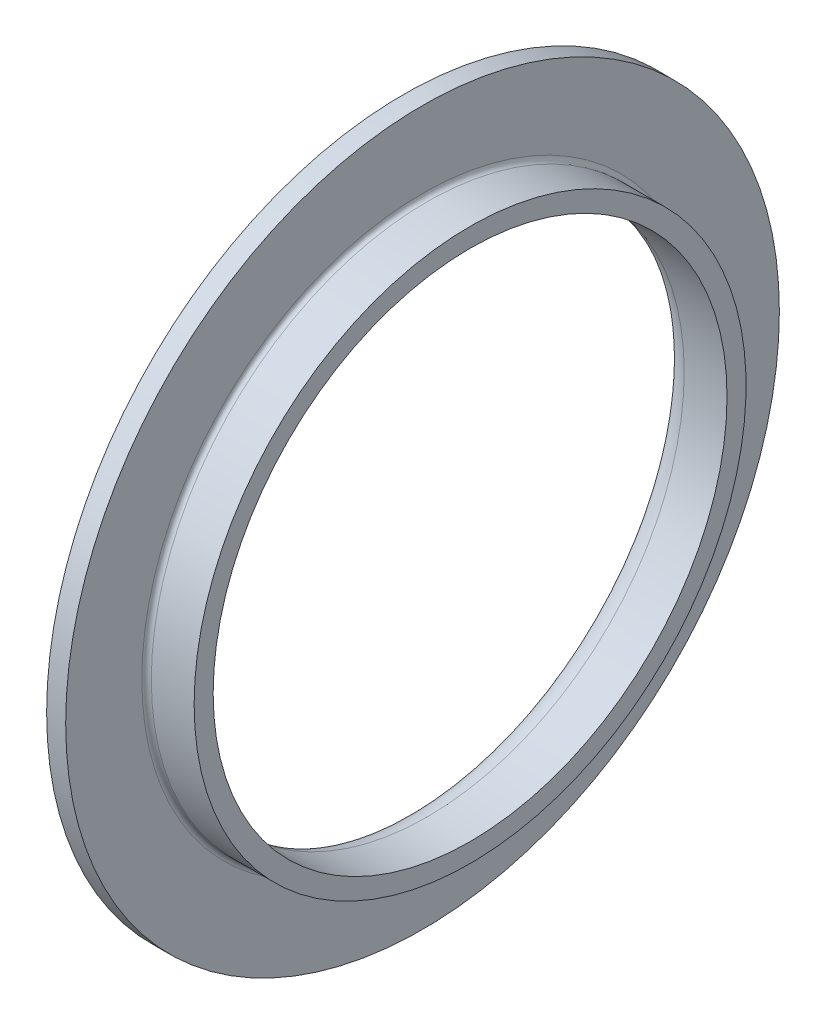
ISO-10303-21;
HEADER;
FILE_DESCRIPTION(('STEP AP214'),'2;1');
FILE_NAME('part.step','',(''),(''),'','','');
FILE_SCHEMA(('AUTOMOTIVE_DESIGN { 1 0 10303 214 1 1 1 1 }'));
ENDSEC;
DATA;
#1=APPLICATION_CONTEXT('core data for automotive mechanical design processes');
#2=APPLICATION_PROTOCOL_DEFINITION('international standard','automotive_design',2000,#1);
#3=PRODUCT_CONTEXT('',#1,'mechanical');
#4=PRODUCT('Part','Part','',(#3));
#5=PRODUCT_RELATED_PRODUCT_CATEGORY('part','',(#4));
#6=PRODUCT_DEFINITION_FORMATION('','',#4);
#7=PRODUCT_DEFINITION_CONTEXT('part definition',#1,'design');
#8=PRODUCT_DEFINITION('design','',#6,#7);
#9=PRODUCT_DEFINITION_SHAPE('','',#8);
#10=(LENGTH_UNIT() NAMED_UNIT(*) SI_UNIT(.MILLI.,.METRE.));
#11=(NAMED_UNIT(*) PLANE_ANGLE_UNIT() SI_UNIT($,.RADIAN.));
#12=(NAMED_UNIT(*) SI_UNIT($,.STERADIAN.) SOLID_ANGLE_UNIT());
#13=UNCERTAINTY_MEASURE_WITH_UNIT(LENGTH_MEASURE(1.E-05),#10,'distance_accuracy_value','');
#14=(GEOMETRIC_REPRESENTATION_CONTEXT(3) GLOBAL_UNCERTAINTY_ASSIGNED_CONTEXT((#13)) GLOBAL_UNIT_ASSIGNED_CONTEXT((#10,
#11,#12)) REPRESENTATION_CONTEXT('',''));
#15=CARTESIAN_POINT('',(0.,0.,0.));
#16=DIRECTION('',(0.,0.,1.));
#17=DIRECTION('',(1.,0.,0.));
#18=AXIS2_PLACEMENT_3D('',#15,#16,#17);
#19=CARTESIAN_POINT('',(0.,0.,0.));
#20=DIRECTION('',(-1.,0.,0.));
#21=DIRECTION('',(0.,0.,1.));
#22=AXIS2_PLACEMENT_3D('',#19,#20,#21);
#23=CYLINDRICAL_SURFACE('',#22,27.);
#24=CARTESIAN_POINT('',(7.,0.,0.));
#25=DIRECTION('',(-1.,0.,0.));
#26=DIRECTION('',(0.,0.,1.));
#27=AXIS2_PLACEMENT_3D('',#24,#25,#26);
#28=CIRCLE('',#27,27.);
#29=CARTESIAN_POINT('',(7.,0.,27.));
#30=VERTEX_POINT('',#29);
#31=EDGE_CURVE('E10',#30,#30,#28,.T.);
#32=ORIENTED_EDGE('',*,*,#31,.F.);
#33=EDGE_LOOP('',(#32));
#34=FACE_BOUND('',#33,.T.);
#35=CARTESIAN_POINT('',(2.50000000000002,0.,0.));
#36=DIRECTION('',(-1.,0.,0.));
#37=DIRECTION('',(0.,0.,1.));
#38=AXIS2_PLACEMENT_3D('',#35,#36,#37);
#39=CIRCLE('',#38,27.);
#40=CARTESIAN_POINT('',(2.50000000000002,0.,27.));
#41=VERTEX_POINT('',#40);
#42=EDGE_CURVE('E58',#41,#41,#39,.T.);
#43=ORIENTED_EDGE('',*,*,#42,.T.);
#44=EDGE_LOOP('',(#43));
#45=FACE_BOUND('',#44,.T.);
#46=ADVANCED_FACE('F30',(#34,#45),#23,.F.);
#47=CARTESIAN_POINT('',(7.,29.,0.));
#48=DIRECTION('',(1.,0.,0.));
#49=DIRECTION('',(0.,0.,-1.));
#50=AXIS2_PLACEMENT_3D('',#47,#48,#49);
#51=PLANE('',#50);
#52=ORIENTED_EDGE('',*,*,#31,.T.);
#53=EDGE_LOOP('',(#52));
#54=FACE_BOUND('',#53,.T.);
#55=CARTESIAN_POINT('',(7.,0.,0.));
#56=DIRECTION('',(-1.,0.,0.));
#57=DIRECTION('',(0.,0.,1.));
#58=AXIS2_PLACEMENT_3D('',#55,#56,#57);
#59=CIRCLE('',#58,29.);
#60=CARTESIAN_POINT('',(7.,0.,29.));
#61=VERTEX_POINT('',#60);
#62=EDGE_CURVE('E36',#61,#61,#59,.T.);
#63=ORIENTED_EDGE('',*,*,#62,.F.);
#64=EDGE_LOOP('',(#63));
#65=FACE_BOUND('',#64,.T.);
#66=ADVANCED_FACE('F87',(#54,#65),#51,.T.);
#67=CARTESIAN_POINT('',(0.,0.,0.));
#68=DIRECTION('',(-1.,0.,0.));
#69=DIRECTION('',(0.,0.,1.));
#70=AXIS2_PLACEMENT_3D('',#67,#68,#69);
#71=CYLINDRICAL_SURFACE('',#70,29.);
#72=ORIENTED_EDGE('',*,*,#62,.T.);
#73=EDGE_LOOP('',(#72));
#74=FACE_BOUND('',#73,.T.);
#75=CARTESIAN_POINT('',(2.50000000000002,0.,0.));
#76=DIRECTION('',(-1.,0.,0.));
#77=DIRECTION('',(0.,0.,1.));
#78=AXIS2_PLACEMENT_3D('',#75,#76,#77);
#79=CIRCLE('',#78,29.);
#80=CARTESIAN_POINT('',(2.50000000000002,0.,29.));
#81=VERTEX_POINT('',#80);
#82=EDGE_CURVE('E40',#81,#81,#79,.T.);
#83=ORIENTED_EDGE('',*,*,#82,.F.);
#84=EDGE_LOOP('',(#83));
#85=FACE_BOUND('',#84,.T.);
#86=ADVANCED_FACE('F92',(#74,#85),#71,.T.);
#87=CARTESIAN_POINT('',(2.5,0.,0.));
#88=DIRECTION('',(-1.,0.,0.));
#89=DIRECTION('',(0.,0.,1.));
#90=AXIS2_PLACEMENT_3D('',#87,#88,#89);
#91=TOROIDAL_SURFACE('',#90,29.5,0.499999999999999);
#92=ORIENTED_EDGE('',*,*,#82,.T.);
#93=EDGE_LOOP('',(#92));
#94=FACE_BOUND('',#93,.T.);
#95=CARTESIAN_POINT('',(2.,0.,0.));
#96=DIRECTION('',(-1.,0.,0.));
#97=DIRECTION('',(0.,0.,1.));
#98=AXIS2_PLACEMENT_3D('',#95,#96,#97);
#99=CIRCLE('',#98,29.5);
#100=CARTESIAN_POINT('',(2.,0.,29.5));
#101=VERTEX_POINT('',#100);
#102=EDGE_CURVE('E44',#101,#101,#99,.T.);
#103=ORIENTED_EDGE('',*,*,#102,.F.);
#104=EDGE_LOOP('',(#103));
#105=FACE_BOUND('',#104,.T.);
#106=ADVANCED_FACE('F83',(#94,#105),#91,.F.);
#107=CARTESIAN_POINT('',(2.,37.5,0.));
#108=DIRECTION('',(1.,0.,0.));
#109=DIRECTION('',(0.,0.,-1.));
#110=AXIS2_PLACEMENT_3D('',#107,#108,#109);
#111=PLANE('',#110);
#112=ORIENTED_EDGE('',*,*,#102,.T.);
#113=EDGE_LOOP('',(#112));
#114=FACE_BOUND('',#113,.T.);
#115=CARTESIAN_POINT('',(2.,0.,0.));
#116=DIRECTION('',(-1.,0.,0.));
#117=DIRECTION('',(0.,0.,1.));
#118=AXIS2_PLACEMENT_3D('',#115,#116,#117);
#119=CIRCLE('',#118,37.5);
#120=CARTESIAN_POINT('',(2.,0.,37.5));
#121=VERTEX_POINT('',#120);
#122=EDGE_CURVE('E49',#121,#121,#119,.T.);
#123=ORIENTED_EDGE('',*,*,#122,.F.);
#124=EDGE_LOOP('',(#123));
#125=FACE_BOUND('',#124,.T.);
#126=ADVANCED_FACE('F77',(#114,#125),#111,.T.);
#127=CARTESIAN_POINT('',(0.,0.,0.));
#128=DIRECTION('',(-1.,0.,0.));
#129=DIRECTION('',(0.,0.,1.));
#130=AXIS2_PLACEMENT_3D('',#127,#128,#129);
#131=CYLINDRICAL_SURFACE('',#130,37.5);
#132=ORIENTED_EDGE('',*,*,#122,.T.);
#133=EDGE_LOOP('',(#132));
#134=FACE_BOUND('',#133,.T.);
#135=CARTESIAN_POINT('',(0.,0.,0.));
#136=DIRECTION('',(-1.,0.,0.));
#137=DIRECTION('',(0.,0.,1.));
#138=AXIS2_PLACEMENT_3D('',#135,#136,#137);
#139=CIRCLE('',#138,37.5);
#140=CARTESIAN_POINT('',(0.,0.,37.5));
#141=VERTEX_POINT('',#140);
#142=EDGE_CURVE('E52',#141,#141,#139,.T.);
#143=ORIENTED_EDGE('',*,*,#142,.F.);
#144=EDGE_LOOP('',(#143));
#145=FACE_BOUND('',#144,.T.);
#146=ADVANCED_FACE('F72',(#134,#145),#131,.T.);
#147=CARTESIAN_POINT('',(0.,37.5,0.));
#148=DIRECTION('',(1.,0.,0.));
#149=DIRECTION('',(0.,0.,-1.));
#150=AXIS2_PLACEMENT_3D('',#147,#148,#149);
#151=PLANE('',#150);
#152=CARTESIAN_POINT('',(0.,0.,0.));
#153=DIRECTION('',(-1.,0.,0.));
#154=DIRECTION('',(0.,0.,1.));
#155=AXIS2_PLACEMENT_3D('',#152,#153,#154);
#156=CIRCLE('',#155,29.5);
#157=CARTESIAN_POINT('',(0.,0.,29.5));
#158=VERTEX_POINT('',#157);
#159=EDGE_CURVE('E55',#158,#158,#156,.T.);
#160=ORIENTED_EDGE('',*,*,#159,.F.);
#161=EDGE_LOOP('',(#160));
#162=FACE_BOUND('',#161,.T.);
#163=ORIENTED_EDGE('',*,*,#142,.T.);
#164=EDGE_LOOP('',(#163));
#165=FACE_BOUND('',#164,.T.);
#166=ADVANCED_FACE('F66',(#162,#165),#151,.F.);
#167=CARTESIAN_POINT('',(2.5,0.,0.));
#168=DIRECTION('',(-1.,0.,0.));
#169=DIRECTION('',(0.,0.,1.));
#170=AXIS2_PLACEMENT_3D('',#167,#168,#169);
#171=TOROIDAL_SURFACE('',#170,29.5,2.5);
#172=ORIENTED_EDGE('',*,*,#42,.F.);
#173=EDGE_LOOP('',(#172));
#174=FACE_BOUND('',#173,.T.);
#175=ORIENTED_EDGE('',*,*,#159,.T.);
#176=EDGE_LOOP('',(#175));
#177=FACE_BOUND('',#176,.T.);
#178=ADVANCED_FACE('F63',(#174,#177),#171,.T.);
#179=CLOSED_SHELL('',(#46,#66,#86,#106,#126,#146,#166,#178));
#180=MANIFOLD_SOLID_BREP('B2',#179);
#181=ADVANCED_BREP_SHAPE_REPRESENTATION('',(#18,#180),#14);
#182=SHAPE_DEFINITION_REPRESENTATION(#9,#181);
ENDSEC;
END-ISO-10303-21;
